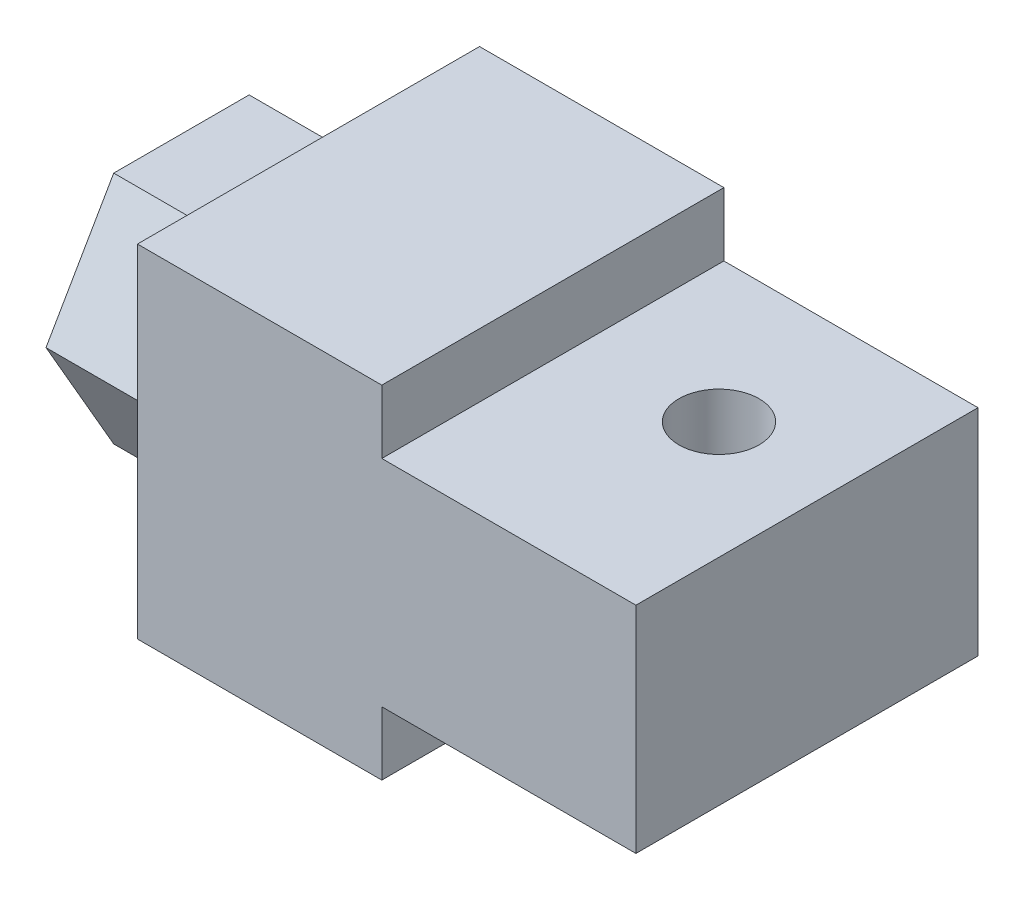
ISO-10303-21;
HEADER;
FILE_DESCRIPTION(('STEP AP214'),'2;1');
FILE_NAME('part.step','',(''),(''),'','','');
FILE_SCHEMA(('AUTOMOTIVE_DESIGN { 1 0 10303 214 1 1 1 1 }'));
ENDSEC;
DATA;
#1=APPLICATION_CONTEXT('core data for automotive mechanical design processes');
#2=APPLICATION_PROTOCOL_DEFINITION('international standard','automotive_design',2000,#1);
#3=PRODUCT_CONTEXT('',#1,'mechanical');
#4=PRODUCT('Part','Part','',(#3));
#5=PRODUCT_RELATED_PRODUCT_CATEGORY('part','',(#4));
#6=PRODUCT_DEFINITION_FORMATION('','',#4);
#7=PRODUCT_DEFINITION_CONTEXT('part definition',#1,'design');
#8=PRODUCT_DEFINITION('design','',#6,#7);
#9=PRODUCT_DEFINITION_SHAPE('','',#8);
#10=(LENGTH_UNIT() NAMED_UNIT(*) SI_UNIT(.MILLI.,.METRE.));
#11=(NAMED_UNIT(*) PLANE_ANGLE_UNIT() SI_UNIT($,.RADIAN.));
#12=(NAMED_UNIT(*) SI_UNIT($,.STERADIAN.) SOLID_ANGLE_UNIT());
#13=UNCERTAINTY_MEASURE_WITH_UNIT(LENGTH_MEASURE(1.E-05),#10,'distance_accuracy_value','');
#14=(GEOMETRIC_REPRESENTATION_CONTEXT(3) GLOBAL_UNCERTAINTY_ASSIGNED_CONTEXT((#13)) GLOBAL_UNIT_ASSIGNED_CONTEXT((#10,
#11,#12)) REPRESENTATION_CONTEXT('',''));
#15=CARTESIAN_POINT('',(0.,0.,0.));
#16=DIRECTION('',(0.,0.,1.));
#17=DIRECTION('',(1.,0.,0.));
#18=AXIS2_PLACEMENT_3D('',#15,#16,#17);
#19=CARTESIAN_POINT('',(51.,17.5,17.5));
#20=DIRECTION('',(0.,1.,0.));
#21=DIRECTION('',(0.,0.,-1.));
#22=AXIS2_PLACEMENT_3D('',#19,#20,#21);
#23=PLANE('',#22);
#24=DIRECTION('',(-1.,0.,0.));
#25=VECTOR('',#24,1.);
#26=CARTESIAN_POINT('',(51.,17.5,17.5));
#27=LINE('',#26,#25);
#28=CARTESIAN_POINT('',(25.,17.5,17.5));
#29=VERTEX_POINT('',#28);
#30=CARTESIAN_POINT('',(0.,17.5,17.5));
#31=VERTEX_POINT('',#30);
#32=EDGE_CURVE('E23',#29,#31,#27,.T.);
#33=ORIENTED_EDGE('',*,*,#32,.F.);
#34=DIRECTION('',(0.,0.,-1.));
#35=VECTOR('',#34,1.);
#36=CARTESIAN_POINT('',(25.,17.5,17.5));
#37=LINE('',#36,#35);
#38=CARTESIAN_POINT('',(25.,17.5,-17.5));
#39=VERTEX_POINT('',#38);
#40=EDGE_CURVE('E193',#29,#39,#37,.T.);
#41=ORIENTED_EDGE('',*,*,#40,.T.);
#42=DIRECTION('',(-1.,0.,0.));
#43=VECTOR('',#42,1.);
#44=CARTESIAN_POINT('',(51.,17.5,-17.5));
#45=LINE('',#44,#43);
#46=CARTESIAN_POINT('',(0.,17.5,-17.5));
#47=VERTEX_POINT('',#46);
#48=EDGE_CURVE('E227',#39,#47,#45,.T.);
#49=ORIENTED_EDGE('',*,*,#48,.T.);
#50=DIRECTION('',(0.,0.,-1.));
#51=VECTOR('',#50,1.);
#52=CARTESIAN_POINT('',(0.,17.5,17.5));
#53=LINE('',#52,#51);
#54=EDGE_CURVE('E210',#31,#47,#53,.T.);
#55=ORIENTED_EDGE('',*,*,#54,.F.);
#56=EDGE_LOOP('',(#33,#41,#49,#55));
#57=FACE_BOUND('',#56,.T.);
#58=ADVANCED_FACE('F14',(#57),#23,.T.);
#59=CARTESIAN_POINT('',(51.,17.5,17.5));
#60=DIRECTION('',(0.,0.,-1.));
#61=DIRECTION('',(1.,0.,0.));
#62=AXIS2_PLACEMENT_3D('',#59,#60,#61);
#63=PLANE('',#62);
#64=DIRECTION('',(0.,1.,0.));
#65=VECTOR('',#64,1.);
#66=CARTESIAN_POINT('',(25.,11.,17.5));
#67=LINE('',#66,#65);
#68=CARTESIAN_POINT('',(25.,11.,17.5));
#69=VERTEX_POINT('',#68);
#70=EDGE_CURVE('E181',#69,#29,#67,.T.);
#71=ORIENTED_EDGE('',*,*,#70,.T.);
#72=ORIENTED_EDGE('',*,*,#32,.T.);
#73=DIRECTION('',(0.,-1.,0.));
#74=VECTOR('',#73,1.);
#75=CARTESIAN_POINT('',(0.,17.5,17.5));
#76=LINE('',#75,#74);
#77=CARTESIAN_POINT('',(0.,-17.5,17.5));
#78=VERTEX_POINT('',#77);
#79=EDGE_CURVE('E219',#31,#78,#76,.T.);
#80=ORIENTED_EDGE('',*,*,#79,.T.);
#81=DIRECTION('',(-1.,0.,0.));
#82=VECTOR('',#81,1.);
#83=CARTESIAN_POINT('',(51.,-17.5,17.5));
#84=LINE('',#83,#82);
#85=CARTESIAN_POINT('',(25.,-17.5,17.5));
#86=VERTEX_POINT('',#85);
#87=EDGE_CURVE('E231',#86,#78,#84,.T.);
#88=ORIENTED_EDGE('',*,*,#87,.F.);
#89=DIRECTION('',(0.,-1.,0.));
#90=VECTOR('',#89,1.);
#91=CARTESIAN_POINT('',(25.,-11.,17.5));
#92=LINE('',#91,#90);
#93=CARTESIAN_POINT('',(25.,-11.,17.5));
#94=VERTEX_POINT('',#93);
#95=EDGE_CURVE('E196',#94,#86,#92,.T.);
#96=ORIENTED_EDGE('',*,*,#95,.F.);
#97=DIRECTION('',(1.,0.,0.));
#98=VECTOR('',#97,1.);
#99=CARTESIAN_POINT('',(25.,-11.,17.5));
#100=LINE('',#99,#98);
#101=CARTESIAN_POINT('',(51.,-11.,17.5));
#102=VERTEX_POINT('',#101);
#103=EDGE_CURVE('E198',#94,#102,#100,.T.);
#104=ORIENTED_EDGE('',*,*,#103,.T.);
#105=DIRECTION('',(0.,-1.,0.));
#106=VECTOR('',#105,1.);
#107=CARTESIAN_POINT('',(51.,17.5,17.5));
#108=LINE('',#107,#106);
#109=CARTESIAN_POINT('',(51.,11.,17.5));
#110=VERTEX_POINT('',#109);
#111=EDGE_CURVE('E225',#110,#102,#108,.T.);
#112=ORIENTED_EDGE('',*,*,#111,.F.);
#113=DIRECTION('',(1.,0.,0.));
#114=VECTOR('',#113,1.);
#115=CARTESIAN_POINT('',(25.,11.,17.5));
#116=LINE('',#115,#114);
#117=EDGE_CURVE('E184',#69,#110,#116,.T.);
#118=ORIENTED_EDGE('',*,*,#117,.F.);
#119=EDGE_LOOP('',(#71,#72,#80,#88,#96,#104,#112,#118));
#120=FACE_BOUND('',#119,.T.);
#121=ADVANCED_FACE('F16',(#120),#63,.F.);
#122=CARTESIAN_POINT('',(51.,-17.5,-17.5));
#123=DIRECTION('',(0.,0.,1.));
#124=DIRECTION('',(0.,1.,0.));
#125=AXIS2_PLACEMENT_3D('',#122,#123,#124);
#126=PLANE('',#125);
#127=DIRECTION('',(0.,1.,0.));
#128=VECTOR('',#127,1.);
#129=CARTESIAN_POINT('',(25.,11.,-17.5));
#130=LINE('',#129,#128);
#131=CARTESIAN_POINT('',(25.,11.,-17.5));
#132=VERTEX_POINT('',#131);
#133=EDGE_CURVE('E186',#132,#39,#130,.T.);
#134=ORIENTED_EDGE('',*,*,#133,.F.);
#135=DIRECTION('',(1.,0.,0.));
#136=VECTOR('',#135,1.);
#137=CARTESIAN_POINT('',(25.,11.,-17.5));
#138=LINE('',#137,#136);
#139=CARTESIAN_POINT('',(51.,11.,-17.5));
#140=VERTEX_POINT('',#139);
#141=EDGE_CURVE('E188',#132,#140,#138,.T.);
#142=ORIENTED_EDGE('',*,*,#141,.T.);
#143=DIRECTION('',(0.,1.,0.));
#144=VECTOR('',#143,1.);
#145=CARTESIAN_POINT('',(51.,-17.5,-17.5));
#146=LINE('',#145,#144);
#147=CARTESIAN_POINT('',(51.,-11.,-17.5));
#148=VERTEX_POINT('',#147);
#149=EDGE_CURVE('E222',#148,#140,#146,.T.);
#150=ORIENTED_EDGE('',*,*,#149,.F.);
#151=DIRECTION('',(1.,0.,0.));
#152=VECTOR('',#151,1.);
#153=CARTESIAN_POINT('',(25.,-11.,-17.5));
#154=LINE('',#153,#152);
#155=CARTESIAN_POINT('',(25.,-11.,-17.5));
#156=VERTEX_POINT('',#155);
#157=EDGE_CURVE('E204',#156,#148,#154,.T.);
#158=ORIENTED_EDGE('',*,*,#157,.F.);
#159=DIRECTION('',(0.,-1.,0.));
#160=VECTOR('',#159,1.);
#161=CARTESIAN_POINT('',(25.,-11.,-17.5));
#162=LINE('',#161,#160);
#163=CARTESIAN_POINT('',(25.,-17.5,-17.5));
#164=VERTEX_POINT('',#163);
#165=EDGE_CURVE('E201',#156,#164,#162,.T.);
#166=ORIENTED_EDGE('',*,*,#165,.T.);
#167=DIRECTION('',(-1.,0.,0.));
#168=VECTOR('',#167,1.);
#169=CARTESIAN_POINT('',(51.,-17.5,-17.5));
#170=LINE('',#169,#168);
#171=CARTESIAN_POINT('',(0.,-17.5,-17.5));
#172=VERTEX_POINT('',#171);
#173=EDGE_CURVE('E229',#164,#172,#170,.T.);
#174=ORIENTED_EDGE('',*,*,#173,.T.);
#175=DIRECTION('',(0.,1.,0.));
#176=VECTOR('',#175,1.);
#177=CARTESIAN_POINT('',(0.,-17.5,-17.5));
#178=LINE('',#177,#176);
#179=EDGE_CURVE('E213',#172,#47,#178,.T.);
#180=ORIENTED_EDGE('',*,*,#179,.T.);
#181=ORIENTED_EDGE('',*,*,#48,.F.);
#182=EDGE_LOOP('',(#134,#142,#150,#158,#166,#174,#180,#181));
#183=FACE_BOUND('',#182,.T.);
#184=ADVANCED_FACE('F263',(#183),#126,.F.);
#185=CARTESIAN_POINT('',(51.,17.5,-17.5));
#186=DIRECTION('',(1.,0.,0.));
#187=DIRECTION('',(0.,1.,0.));
#188=AXIS2_PLACEMENT_3D('',#185,#186,#187);
#189=PLANE('',#188);
#190=DIRECTION('',(0.,0.,-1.));
#191=VECTOR('',#190,1.);
#192=CARTESIAN_POINT('',(51.,11.,-17.5));
#193=LINE('',#192,#191);
#194=EDGE_CURVE('E38',#110,#140,#193,.T.);
#195=ORIENTED_EDGE('',*,*,#194,.F.);
#196=ORIENTED_EDGE('',*,*,#111,.T.);
#197=DIRECTION('',(0.,0.,-1.));
#198=VECTOR('',#197,1.);
#199=CARTESIAN_POINT('',(51.,-11.,-17.5));
#200=LINE('',#199,#198);
#201=EDGE_CURVE('E9',#102,#148,#200,.T.);
#202=ORIENTED_EDGE('',*,*,#201,.T.);
#203=ORIENTED_EDGE('',*,*,#149,.T.);
#204=EDGE_LOOP('',(#195,#196,#202,#203));
#205=FACE_BOUND('',#204,.T.);
#206=ADVANCED_FACE('F260',(#205),#189,.T.);
#207=CARTESIAN_POINT('',(51.,-17.5,-17.5));
#208=DIRECTION('',(0.,-1.,0.));
#209=DIRECTION('',(1.,0.,0.));
#210=AXIS2_PLACEMENT_3D('',#207,#208,#209);
#211=PLANE('',#210);
#212=DIRECTION('',(0.,0.,-1.));
#213=VECTOR('',#212,1.);
#214=CARTESIAN_POINT('',(25.,-17.5,-17.5));
#215=LINE('',#214,#213);
#216=EDGE_CURVE('E208',#86,#164,#215,.T.);
#217=ORIENTED_EDGE('',*,*,#216,.F.);
#218=ORIENTED_EDGE('',*,*,#87,.T.);
#219=DIRECTION('',(0.,0.,1.));
#220=VECTOR('',#219,1.);
#221=CARTESIAN_POINT('',(0.,-17.5,-17.5));
#222=LINE('',#221,#220);
#223=EDGE_CURVE('E216',#172,#78,#222,.T.);
#224=ORIENTED_EDGE('',*,*,#223,.F.);
#225=ORIENTED_EDGE('',*,*,#173,.F.);
#226=EDGE_LOOP('',(#217,#218,#224,#225));
#227=FACE_BOUND('',#226,.T.);
#228=ADVANCED_FACE('F247',(#227),#211,.T.);
#229=CARTESIAN_POINT('',(0.,17.5,-17.5));
#230=DIRECTION('',(1.,0.,0.));
#231=DIRECTION('',(0.,1.,0.));
#232=AXIS2_PLACEMENT_3D('',#229,#230,#231);
#233=PLANE('',#232);
#234=DIRECTION('',(0.,0.,-1.));
#235=VECTOR('',#234,1.);
#236=CARTESIAN_POINT('',(0.,-12.,6.92820323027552));
#237=LINE('',#236,#235);
#238=CARTESIAN_POINT('',(0.,-12.,6.92820323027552));
#239=VERTEX_POINT('',#238);
#240=CARTESIAN_POINT('',(0.,-12.,-6.92820323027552));
#241=VERTEX_POINT('',#240);
#242=EDGE_CURVE('E139',#239,#241,#237,.T.);
#243=ORIENTED_EDGE('',*,*,#242,.T.);
#244=DIRECTION('',(0.,0.866025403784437,-0.5));
#245=VECTOR('',#244,1.);
#246=CARTESIAN_POINT('',(0.,-12.,-6.92820323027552));
#247=LINE('',#246,#245);
#248=CARTESIAN_POINT('',(0.,0.,-13.8564064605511));
#249=VERTEX_POINT('',#248);
#250=EDGE_CURVE('E30',#241,#249,#247,.T.);
#251=ORIENTED_EDGE('',*,*,#250,.T.);
#252=DIRECTION('',(0.,-0.866025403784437,-0.5));
#253=VECTOR('',#252,1.);
#254=CARTESIAN_POINT('',(0.,12.,-6.92820323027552));
#255=LINE('',#254,#253);
#256=CARTESIAN_POINT('',(0.,12.,-6.92820323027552));
#257=VERTEX_POINT('',#256);
#258=EDGE_CURVE('E127',#257,#249,#255,.T.);
#259=ORIENTED_EDGE('',*,*,#258,.F.);
#260=DIRECTION('',(0.,0.,-1.));
#261=VECTOR('',#260,1.);
#262=CARTESIAN_POINT('',(0.,12.,6.92820323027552));
#263=LINE('',#262,#261);
#264=CARTESIAN_POINT('',(0.,12.,6.92820323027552));
#265=VERTEX_POINT('',#264);
#266=EDGE_CURVE('E132',#265,#257,#263,.T.);
#267=ORIENTED_EDGE('',*,*,#266,.F.);
#268=DIRECTION('',(0.,-0.866025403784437,0.5));
#269=VECTOR('',#268,1.);
#270=CARTESIAN_POINT('',(0.,12.,6.92820323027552));
#271=LINE('',#270,#269);
#272=CARTESIAN_POINT('',(0.,0.,13.8564064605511));
#273=VERTEX_POINT('',#272);
#274=EDGE_CURVE('E148',#265,#273,#271,.T.);
#275=ORIENTED_EDGE('',*,*,#274,.T.);
#276=DIRECTION('',(0.,0.866025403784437,0.5));
#277=VECTOR('',#276,1.);
#278=CARTESIAN_POINT('',(0.,-12.,6.92820323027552));
#279=LINE('',#278,#277);
#280=EDGE_CURVE('E151',#239,#273,#279,.T.);
#281=ORIENTED_EDGE('',*,*,#280,.F.);
#282=EDGE_LOOP('',(#243,#251,#259,#267,#275,#281));
#283=FACE_BOUND('',#282,.T.);
#284=ORIENTED_EDGE('',*,*,#54,.T.);
#285=ORIENTED_EDGE('',*,*,#179,.F.);
#286=ORIENTED_EDGE('',*,*,#223,.T.);
#287=ORIENTED_EDGE('',*,*,#79,.F.);
#288=EDGE_LOOP('',(#284,#285,#286,#287));
#289=FACE_BOUND('',#288,.T.);
#290=ADVANCED_FACE('F135',(#283,#289),#233,.F.);
#291=CARTESIAN_POINT('',(25.,-11.,-17.5));
#292=DIRECTION('',(-1.,0.,0.));
#293=DIRECTION('',(0.,-1.,0.));
#294=AXIS2_PLACEMENT_3D('',#291,#292,#293);
#295=PLANE('',#294);
#296=ORIENTED_EDGE('',*,*,#216,.T.);
#297=ORIENTED_EDGE('',*,*,#165,.F.);
#298=DIRECTION('',(0.,0.,1.));
#299=VECTOR('',#298,1.);
#300=CARTESIAN_POINT('',(25.,-11.,-17.5));
#301=LINE('',#300,#299);
#302=EDGE_CURVE('E206',#156,#94,#301,.T.);
#303=ORIENTED_EDGE('',*,*,#302,.T.);
#304=ORIENTED_EDGE('',*,*,#95,.T.);
#305=EDGE_LOOP('',(#296,#297,#303,#304));
#306=FACE_BOUND('',#305,.T.);
#307=ADVANCED_FACE('F252',(#306),#295,.F.);
#308=CARTESIAN_POINT('',(25.,-11.,-17.5));
#309=DIRECTION('',(0.,-1.,0.));
#310=DIRECTION('',(1.,0.,0.));
#311=AXIS2_PLACEMENT_3D('',#308,#309,#310);
#312=PLANE('',#311);
#313=CARTESIAN_POINT('',(39.,-11.,-3.));
#314=DIRECTION('',(0.,-1.,0.));
#315=DIRECTION('',(1.,0.,0.));
#316=AXIS2_PLACEMENT_3D('',#313,#314,#315);
#317=CIRCLE('',#316,4.1);
#318=CARTESIAN_POINT('',(43.1,-11.,-3.));
#319=VERTEX_POINT('',#318);
#320=EDGE_CURVE('E178',#319,#319,#317,.T.);
#321=ORIENTED_EDGE('',*,*,#320,.F.);
#322=EDGE_LOOP('',(#321));
#323=FACE_BOUND('',#322,.T.);
#324=ORIENTED_EDGE('',*,*,#103,.F.);
#325=ORIENTED_EDGE('',*,*,#302,.F.);
#326=ORIENTED_EDGE('',*,*,#157,.T.);
#327=ORIENTED_EDGE('',*,*,#201,.F.);
#328=EDGE_LOOP('',(#324,#325,#326,#327));
#329=FACE_BOUND('',#328,.T.);
#330=ADVANCED_FACE('F257',(#323,#329),#312,.T.);
#331=CARTESIAN_POINT('',(25.,11.,-17.5));
#332=DIRECTION('',(1.,0.,0.));
#333=DIRECTION('',(0.,1.,0.));
#334=AXIS2_PLACEMENT_3D('',#331,#332,#333);
#335=PLANE('',#334);
#336=ORIENTED_EDGE('',*,*,#70,.F.);
#337=DIRECTION('',(0.,0.,1.));
#338=VECTOR('',#337,1.);
#339=CARTESIAN_POINT('',(25.,11.,-17.5));
#340=LINE('',#339,#338);
#341=EDGE_CURVE('E190',#132,#69,#340,.T.);
#342=ORIENTED_EDGE('',*,*,#341,.F.);
#343=ORIENTED_EDGE('',*,*,#133,.T.);
#344=ORIENTED_EDGE('',*,*,#40,.F.);
#345=EDGE_LOOP('',(#336,#342,#343,#344));
#346=FACE_BOUND('',#345,.T.);
#347=ADVANCED_FACE('F266',(#346),#335,.T.);
#348=CARTESIAN_POINT('',(25.,11.,-17.5));
#349=DIRECTION('',(0.,-1.,0.));
#350=DIRECTION('',(1.,0.,0.));
#351=AXIS2_PLACEMENT_3D('',#348,#349,#350);
#352=PLANE('',#351);
#353=CARTESIAN_POINT('',(39.,11.,-3.));
#354=DIRECTION('',(0.,-1.,0.));
#355=DIRECTION('',(1.,0.,0.));
#356=AXIS2_PLACEMENT_3D('',#353,#354,#355);
#357=CIRCLE('',#356,4.1);
#358=CARTESIAN_POINT('',(43.1,11.,-3.));
#359=VERTEX_POINT('',#358);
#360=EDGE_CURVE('E18',#359,#359,#357,.T.);
#361=ORIENTED_EDGE('',*,*,#360,.T.);
#362=EDGE_LOOP('',(#361));
#363=FACE_BOUND('',#362,.T.);
#364=ORIENTED_EDGE('',*,*,#194,.T.);
#365=ORIENTED_EDGE('',*,*,#141,.F.);
#366=ORIENTED_EDGE('',*,*,#341,.T.);
#367=ORIENTED_EDGE('',*,*,#117,.T.);
#368=EDGE_LOOP('',(#364,#365,#366,#367));
#369=FACE_BOUND('',#368,.T.);
#370=ADVANCED_FACE('F264',(#363,#369),#352,.F.);
#371=CARTESIAN_POINT('',(39.,17.5,-3.));
#372=DIRECTION('',(0.,-1.,0.));
#373=DIRECTION('',(1.,0.,0.));
#374=AXIS2_PLACEMENT_3D('',#371,#372,#373);
#375=CYLINDRICAL_SURFACE('',#374,4.1);
#376=ORIENTED_EDGE('',*,*,#320,.T.);
#377=EDGE_LOOP('',(#376));
#378=FACE_BOUND('',#377,.T.);
#379=ORIENTED_EDGE('',*,*,#360,.F.);
#380=EDGE_LOOP('',(#379));
#381=FACE_BOUND('',#380,.T.);
#382=ADVANCED_FACE('F275',(#378,#381),#375,.F.);
#383=CARTESIAN_POINT('',(-13.,-12.,-6.92820323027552));
#384=DIRECTION('',(0.,-0.5,-0.866025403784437));
#385=DIRECTION('',(0.,-0.866025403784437,0.5));
#386=AXIS2_PLACEMENT_3D('',#383,#384,#385);
#387=PLANE('',#386);
#388=DIRECTION('',(1.,0.,0.));
#389=VECTOR('',#388,1.);
#390=CARTESIAN_POINT('',(-13.,-12.,-6.92820323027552));
#391=LINE('',#390,#389);
#392=CARTESIAN_POINT('',(-13.,-12.,-6.92820323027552));
#393=VERTEX_POINT('',#392);
#394=EDGE_CURVE('E176',#393,#241,#391,.T.);
#395=ORIENTED_EDGE('',*,*,#394,.F.);
#396=DIRECTION('',(0.,0.866025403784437,-0.5));
#397=VECTOR('',#396,1.);
#398=CARTESIAN_POINT('',(-13.,-12.,-6.92820323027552));
#399=LINE('',#398,#397);
#400=CARTESIAN_POINT('',(-13.,0.,-13.8564064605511));
#401=VERTEX_POINT('',#400);
#402=EDGE_CURVE('E119',#393,#401,#399,.T.);
#403=ORIENTED_EDGE('',*,*,#402,.T.);
#404=DIRECTION('',(1.,0.,0.));
#405=VECTOR('',#404,1.);
#406=CARTESIAN_POINT('',(-13.,0.,-13.8564064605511));
#407=LINE('',#406,#405);
#408=EDGE_CURVE('E115',#401,#249,#407,.T.);
#409=ORIENTED_EDGE('',*,*,#408,.T.);
#410=ORIENTED_EDGE('',*,*,#250,.F.);
#411=EDGE_LOOP('',(#395,#403,#409,#410));
#412=FACE_BOUND('',#411,.T.);
#413=ADVANCED_FACE('F117',(#412),#387,.T.);
#414=CARTESIAN_POINT('',(-13.,-12.,6.92820323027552));
#415=DIRECTION('',(0.,-1.,0.));
#416=DIRECTION('',(1.,0.,0.));
#417=AXIS2_PLACEMENT_3D('',#414,#415,#416);
#418=PLANE('',#417);
#419=DIRECTION('',(1.,0.,0.));
#420=VECTOR('',#419,1.);
#421=CARTESIAN_POINT('',(-13.,-12.,6.92820323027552));
#422=LINE('',#421,#420);
#423=CARTESIAN_POINT('',(-13.,-12.,6.92820323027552));
#424=VERTEX_POINT('',#423);
#425=EDGE_CURVE('E174',#424,#239,#422,.T.);
#426=ORIENTED_EDGE('',*,*,#425,.F.);
#427=DIRECTION('',(0.,0.,-1.));
#428=VECTOR('',#427,1.);
#429=CARTESIAN_POINT('',(-13.,-12.,6.92820323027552));
#430=LINE('',#429,#428);
#431=EDGE_CURVE('E124',#424,#393,#430,.T.);
#432=ORIENTED_EDGE('',*,*,#431,.T.);
#433=ORIENTED_EDGE('',*,*,#394,.T.);
#434=ORIENTED_EDGE('',*,*,#242,.F.);
#435=EDGE_LOOP('',(#426,#432,#433,#434));
#436=FACE_BOUND('',#435,.T.);
#437=ADVANCED_FACE('F354',(#436),#418,.T.);
#438=CARTESIAN_POINT('',(-13.,-12.,6.92820323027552));
#439=DIRECTION('',(0.,0.5,-0.866025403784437));
#440=DIRECTION('',(0.,-0.866025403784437,-0.5));
#441=AXIS2_PLACEMENT_3D('',#438,#439,#440);
#442=PLANE('',#441);
#443=DIRECTION('',(1.,0.,0.));
#444=VECTOR('',#443,1.);
#445=CARTESIAN_POINT('',(-13.,0.,13.8564064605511));
#446=LINE('',#445,#444);
#447=CARTESIAN_POINT('',(-13.,0.,13.8564064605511));
#448=VERTEX_POINT('',#447);
#449=EDGE_CURVE('E172',#448,#273,#446,.T.);
#450=ORIENTED_EDGE('',*,*,#449,.F.);
#451=DIRECTION('',(0.,0.866025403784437,0.5));
#452=VECTOR('',#451,1.);
#453=CARTESIAN_POINT('',(-13.,-12.,6.92820323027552));
#454=LINE('',#453,#452);
#455=EDGE_CURVE('E164',#424,#448,#454,.T.);
#456=ORIENTED_EDGE('',*,*,#455,.F.);
#457=ORIENTED_EDGE('',*,*,#425,.T.);
#458=ORIENTED_EDGE('',*,*,#280,.T.);
#459=EDGE_LOOP('',(#450,#456,#457,#458));
#460=FACE_BOUND('',#459,.T.);
#461=ADVANCED_FACE('F362',(#460),#442,.F.);
#462=CARTESIAN_POINT('',(-13.,12.,6.92820323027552));
#463=DIRECTION('',(0.,0.5,0.866025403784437));
#464=DIRECTION('',(0.,0.866025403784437,-0.5));
#465=AXIS2_PLACEMENT_3D('',#462,#463,#464);
#466=PLANE('',#465);
#467=DIRECTION('',(1.,0.,0.));
#468=VECTOR('',#467,1.);
#469=CARTESIAN_POINT('',(-13.,12.,6.92820323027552));
#470=LINE('',#469,#468);
#471=CARTESIAN_POINT('',(-13.,12.,6.92820323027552));
#472=VERTEX_POINT('',#471);
#473=EDGE_CURVE('E170',#472,#265,#470,.T.);
#474=ORIENTED_EDGE('',*,*,#473,.F.);
#475=DIRECTION('',(0.,-0.866025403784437,0.5));
#476=VECTOR('',#475,1.);
#477=CARTESIAN_POINT('',(-13.,12.,6.92820323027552));
#478=LINE('',#477,#476);
#479=EDGE_CURVE('E161',#472,#448,#478,.T.);
#480=ORIENTED_EDGE('',*,*,#479,.T.);
#481=ORIENTED_EDGE('',*,*,#449,.T.);
#482=ORIENTED_EDGE('',*,*,#274,.F.);
#483=EDGE_LOOP('',(#474,#480,#481,#482));
#484=FACE_BOUND('',#483,.T.);
#485=ADVANCED_FACE('F371',(#484),#466,.T.);
#486=CARTESIAN_POINT('',(-13.,12.,6.92820323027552));
#487=DIRECTION('',(0.,-1.,0.));
#488=DIRECTION('',(1.,0.,0.));
#489=AXIS2_PLACEMENT_3D('',#486,#487,#488);
#490=PLANE('',#489);
#491=DIRECTION('',(1.,0.,0.));
#492=VECTOR('',#491,1.);
#493=CARTESIAN_POINT('',(-13.,12.,-6.92820323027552));
#494=LINE('',#493,#492);
#495=CARTESIAN_POINT('',(-13.,12.,-6.92820323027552));
#496=VERTEX_POINT('',#495);
#497=EDGE_CURVE('E123',#496,#257,#494,.T.);
#498=ORIENTED_EDGE('',*,*,#497,.F.);
#499=DIRECTION('',(0.,0.,-1.));
#500=VECTOR('',#499,1.);
#501=CARTESIAN_POINT('',(-13.,12.,6.92820323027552));
#502=LINE('',#501,#500);
#503=EDGE_CURVE('E158',#472,#496,#502,.T.);
#504=ORIENTED_EDGE('',*,*,#503,.F.);
#505=ORIENTED_EDGE('',*,*,#473,.T.);
#506=ORIENTED_EDGE('',*,*,#266,.T.);
#507=EDGE_LOOP('',(#498,#504,#505,#506));
#508=FACE_BOUND('',#507,.T.);
#509=ADVANCED_FACE('F380',(#508),#490,.F.);
#510=CARTESIAN_POINT('',(-13.,12.,-6.92820323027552));
#511=DIRECTION('',(0.,-0.5,0.866025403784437));
#512=DIRECTION('',(0.,0.866025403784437,0.5));
#513=AXIS2_PLACEMENT_3D('',#510,#511,#512);
#514=PLANE('',#513);
#515=DIRECTION('',(0.,-0.866025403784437,-0.5));
#516=VECTOR('',#515,1.);
#517=CARTESIAN_POINT('',(-13.,12.,-6.92820323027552));
#518=LINE('',#517,#516);
#519=EDGE_CURVE('E156',#496,#401,#518,.T.);
#520=ORIENTED_EDGE('',*,*,#519,.F.);
#521=ORIENTED_EDGE('',*,*,#497,.T.);
#522=ORIENTED_EDGE('',*,*,#258,.T.);
#523=ORIENTED_EDGE('',*,*,#408,.F.);
#524=EDGE_LOOP('',(#520,#521,#522,#523));
#525=FACE_BOUND('',#524,.T.);
#526=ADVANCED_FACE('F128',(#525),#514,.F.);
#527=CARTESIAN_POINT('',(-13.,0.,-13.8564064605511));
#528=DIRECTION('',(-1.,0.,0.));
#529=DIRECTION('',(0.,-1.,0.));
#530=AXIS2_PLACEMENT_3D('',#527,#528,#529);
#531=PLANE('',#530);
#532=CARTESIAN_POINT('',(-13.,0.,0.));
#533=DIRECTION('',(-1.,0.,0.));
#534=DIRECTION('',(0.,-1.,0.));
#535=AXIS2_PLACEMENT_3D('',#532,#533,#534);
#536=CIRCLE('',#535,8.);
#537=CARTESIAN_POINT('',(-13.,-8.,0.));
#538=VERTEX_POINT('',#537);
#539=EDGE_CURVE('E140',#538,#538,#536,.T.);
#540=ORIENTED_EDGE('',*,*,#539,.F.);
#541=EDGE_LOOP('',(#540));
#542=FACE_BOUND('',#541,.T.);
#543=ORIENTED_EDGE('',*,*,#402,.F.);
#544=ORIENTED_EDGE('',*,*,#431,.F.);
#545=ORIENTED_EDGE('',*,*,#455,.T.);
#546=ORIENTED_EDGE('',*,*,#479,.F.);
#547=ORIENTED_EDGE('',*,*,#503,.T.);
#548=ORIENTED_EDGE('',*,*,#519,.T.);
#549=EDGE_LOOP('',(#543,#544,#545,#546,#547,#548));
#550=FACE_BOUND('',#549,.T.);
#551=ADVANCED_FACE('F391',(#542,#550),#531,.T.);
#552=CARTESIAN_POINT('',(12.,0.,0.));
#553=DIRECTION('',(-1.,0.,0.));
#554=DIRECTION('',(0.,-1.,0.));
#555=AXIS2_PLACEMENT_3D('',#552,#553,#554);
#556=CYLINDRICAL_SURFACE('',#555,8.);
#557=ORIENTED_EDGE('',*,*,#539,.T.);
#558=EDGE_LOOP('',(#557));
#559=FACE_BOUND('',#558,.T.);
#560=CARTESIAN_POINT('',(20.,0.,0.));
#561=DIRECTION('',(-1.,0.,0.));
#562=DIRECTION('',(0.,-1.,0.));
#563=AXIS2_PLACEMENT_3D('',#560,#561,#562);
#564=CIRCLE('',#563,8.);
#565=CARTESIAN_POINT('',(20.,-8.,0.));
#566=VERTEX_POINT('',#565);
#567=EDGE_CURVE('E143',#566,#566,#564,.T.);
#568=ORIENTED_EDGE('',*,*,#567,.F.);
#569=EDGE_LOOP('',(#568));
#570=FACE_BOUND('',#569,.T.);
#571=ADVANCED_FACE('F399',(#559,#570),#556,.F.);
#572=CARTESIAN_POINT('',(20.,0.,0.));
#573=DIRECTION('',(-1.,0.,0.));
#574=DIRECTION('',(0.,-1.,0.));
#575=AXIS2_PLACEMENT_3D('',#572,#573,#574);
#576=PLANE('',#575);
#577=ORIENTED_EDGE('',*,*,#567,.T.);
#578=EDGE_LOOP('',(#577));
#579=FACE_BOUND('',#578,.T.);
#580=ADVANCED_FACE('F414',(#579),#576,.T.);
#581=CLOSED_SHELL('',(#58,#121,#184,#206,#228,#290,#307,#330,#347,#370,#382,#413,#437,#461,#485,
#509,#526,#551,#571,#580));
#582=MANIFOLD_SOLID_BREP('B1',#581);
#583=ADVANCED_BREP_SHAPE_REPRESENTATION('',(#18,#582),#14);
#584=SHAPE_DEFINITION_REPRESENTATION(#9,#583);
ENDSEC;
END-ISO-10303-21;
